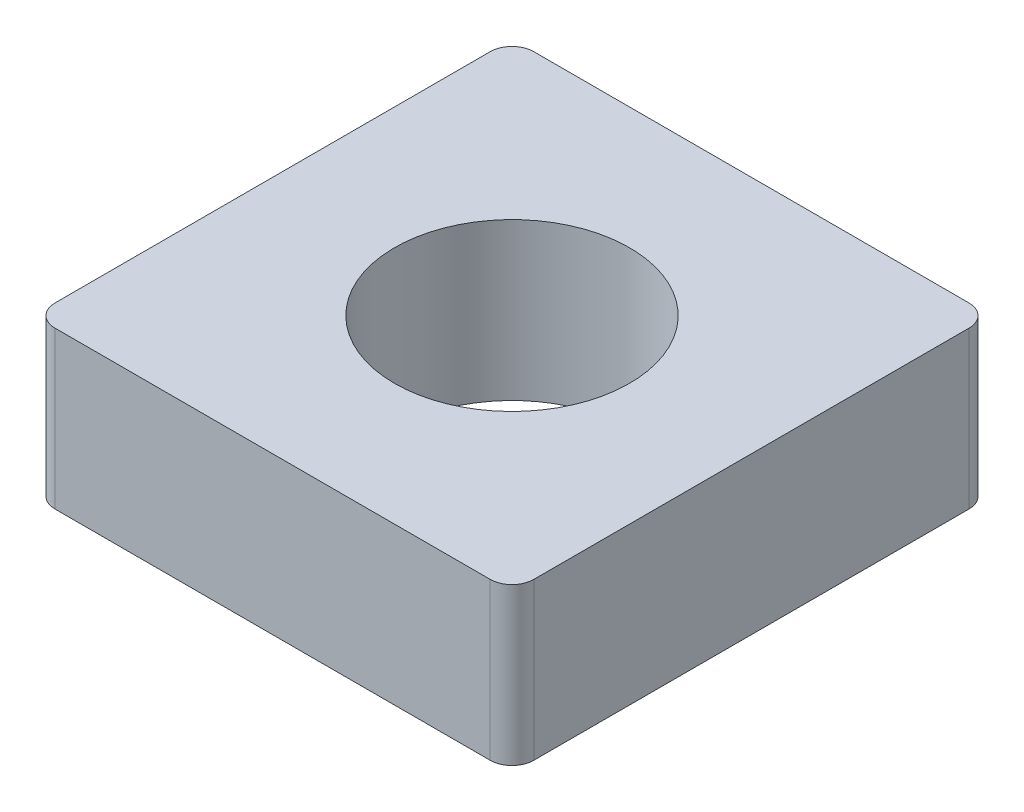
from build123d import *

# Parameters (mm, degrees)
SKETCH1_W           = 5.5
SKETCH1_H           = 5.5
SKETCH1_R           = 1.35
BOSS_EXTRUDE1_DEPTH = 1.8
FILLET1_R           = 0.25


with BuildPart() as part:
    # Sketch1 → Boss-Extrude1 (new body)
    with BuildSketch(Plane(origin=(0, 0, 0), x_dir=(1, 0, 0), z_dir=(0, 1, 0))):
        Rectangle(SKETCH1_W, SKETCH1_H)
        with Locations(Location((0, 0, 0), (0, 0, 270))):
            Circle(SKETCH1_R, mode=Mode.SUBTRACT)
    extrude(amount=BOSS_EXTRUDE1_DEPTH)

    # Fillet1
    fillet1_edges = [part.edges().sort_by_distance(p)[0] for p in [
        (-2.75, 0.9, -2.75),
        (2.75, 0.9, -2.75),
        (2.75, 0.9, 2.75),
        (-2.75, 0.9, 2.75),
    ]]
    fillet(fillet1_edges, radius=FILLET1_R)


solid = part.part
